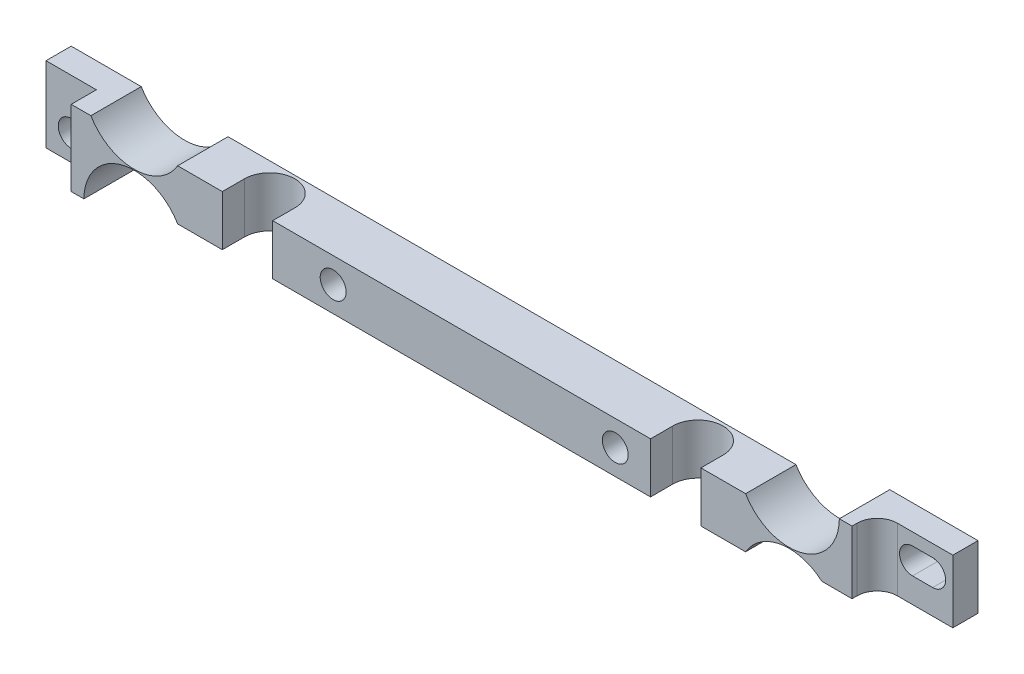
from build123d import *

# Parameters (mm, degrees)
SKETCH1_R          = 1.63195
EXTRUDE1_DEPTH     = 6.35
SKETCH5_W          = 15.98667914
SKETCH5_H          = 1.5875
CUT_EXTRUDE4_DEPTH = 116.178567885
SKETCH6_W          = 6.35
SKETCH6_H          = 3.175
CUT_EXTRUDE5_DEPTH = 116.178567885
CUT_EXTRUDE6_DEPTH = 115.75110634
CUT_EXTRUDE7_DEPTH = 115.871833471
SKETCH9_R          = 1.63195
CUT_EXTRUDE8_DEPTH = 6.35


with BuildPart() as part:
    # Sketch1 → Extrude1 (new body)
    with BuildSketch(Plane.XY):
        with BuildLine():
            Line((0, 9.525), (0, 0))
            Line((0, 0), (7.950403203, 0))
            ThreePointArc((7.950403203, 0), (12.65282779, 6.081790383), (19.769817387, 3.175))
            Line((19.769817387, 3.175), (91.355182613, 3.175))
            ThreePointArc((91.355182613, 3.175), (96.8248, 6.2992), (102.294417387, 3.175))
            Line((102.294417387, 3.175), (114.3, 3.175))
            Line((114.3, 3.175), (114.3, 12.7))
            Line((114.3, 12.7), (103.174596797, 12.7))
            ThreePointArc((103.174596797, 12.7), (98.47217221, 6.618209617), (91.355182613, 9.525))
            Line((91.355182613, 9.525), (19.769817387, 9.525))
            ThreePointArc((19.769817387, 9.525), (14.3002, 6.4008), (8.830582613, 9.525))
            Line((8.830582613, 9.525), (0, 9.525))
        make_face()
        with BuildLine():
            Line((109.22, 11.15695), (111.76, 11.15695))
            ThreePointArc((111.76, 11.15695), (113.39195, 9.525), (111.76, 7.89305))
            Line((111.76, 7.89305), (109.22, 7.89305))
            ThreePointArc((109.22, 7.89305), (107.58805, 9.525), (109.22, 11.15695))
        make_face(mode=Mode.SUBTRACT)
        with Locations(Location((3.175, 3.175, 0), (0, 0, 180))):
            Circle(SKETCH1_R, mode=Mode.SUBTRACT)
    extrude(amount=EXTRUDE1_DEPTH)

    # Sketch5 → Cut-Extrude4 (cut, through all)
    with BuildSketch(Plane(origin=(0, 0, 0), x_dir=(-1, 0, 0), z_dir=(0, 0, -1))):
        with Locations((-106.30666043, 3.96875)):
            Rectangle(SKETCH5_W, SKETCH5_H)
    extrude(amount=-CUT_EXTRUDE4_DEPTH, mode=Mode.SUBTRACT)

    # Sketch6 → Cut-Extrude5 (cut, through all)
    with BuildSketch(Plane.XZ):
        with Locations((3.175, 4.7625)):
            Rectangle(SKETCH6_W, SKETCH6_H)
    extrude(amount=-CUT_EXTRUDE5_DEPTH, mode=Mode.SUBTRACT)

    # Sketch7 → Cut-Extrude6 (cut, through all)
    with BuildSketch(Plane.XZ.offset(-4.7625)):
        with BuildLine():
            Line((114.3, 6.35), (104.775, 6.35))
            Line((104.775, 6.35), (104.775, 5.715))
            ThreePointArc((104.775, 5.715), (105.518948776, 3.918948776), (107.315, 3.175))
            Line((107.315, 3.175), (114.3, 3.175))
            Line((114.3, 3.175), (114.3, 6.35))
        make_face()
    extrude(amount=-CUT_EXTRUDE6_DEPTH, mode=Mode.SUBTRACT)

    # Sketch8 → Cut-Extrude7 (cut, through all)
    with BuildSketch(Plane.XZ.offset(-3.175)):
        with BuildLine():
            Line((25.4, 6.35), (25.4, 3.556))
            ThreePointArc((25.4, 3.556), (25.848403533, 5.182744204), (27.066958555, 6.35))
            Line((27.066958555, 6.35), (25.4, 6.35))
        make_face()
        with BuildLine():
            Line((31.75, 3.556), (31.75, 6.35))
            Line((31.75, 6.35), (30.083041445, 6.35))
            ThreePointArc((30.083041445, 6.35), (31.301596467, 5.182744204), (31.75, 3.556))
        make_face()
        with BuildLine():
            Line((25.4, 3.556), (31.75, 3.556))
            ThreePointArc((31.75, 3.556), (31.301596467, 5.182744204), (30.083041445, 6.35))
            Line((30.083041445, 6.35), (27.066958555, 6.35))
            ThreePointArc((27.066958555, 6.35), (25.848403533, 5.182744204), (25.4, 3.556))
        make_face()
        with BuildLine():
            ThreePointArc((25.4, 3.556), (28.575, 0.381), (31.75, 3.556))
            Line((31.75, 3.556), (25.4, 3.556))
        make_face()
        with BuildLine():
            Line((79.375, 6.35), (79.375, 3.556))
            ThreePointArc((79.375, 3.556), (79.823403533, 5.182744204), (81.041958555, 6.35))
            Line((81.041958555, 6.35), (79.375, 6.35))
        make_face()
        with BuildLine():
            Line((79.375, 3.556), (85.725, 3.556))
            ThreePointArc((85.725, 3.556), (85.276596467, 5.182744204), (84.058041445, 6.35))
            Line((84.058041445, 6.35), (81.041958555, 6.35))
            ThreePointArc((81.041958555, 6.35), (79.823403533, 5.182744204), (79.375, 3.556))
        make_face()
        with BuildLine():
            ThreePointArc((84.058041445, 6.35), (85.276596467, 5.182744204), (85.725, 3.556))
            Line((85.725, 3.556), (85.725, 6.35))
            Line((85.725, 6.35), (84.058041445, 6.35))
        make_face()
        with BuildLine():
            ThreePointArc((79.375, 3.556), (82.55, 0.381), (85.725, 3.556))
            Line((85.725, 3.556), (79.375, 3.556))
        make_face()
    extrude(amount=-CUT_EXTRUDE7_DEPTH, mode=Mode.SUBTRACT)

    # Sketch9 → Cut-Extrude8 (cut)
    with BuildSketch(Plane.XY.offset(6.35)):
        with Locations((39.37, 6.35)):
            Circle(SKETCH9_R)
        with Locations((74.93, 6.35)):
            Circle(SKETCH9_R)
    extrude(amount=-CUT_EXTRUDE8_DEPTH, mode=Mode.SUBTRACT)


solid = part.part
